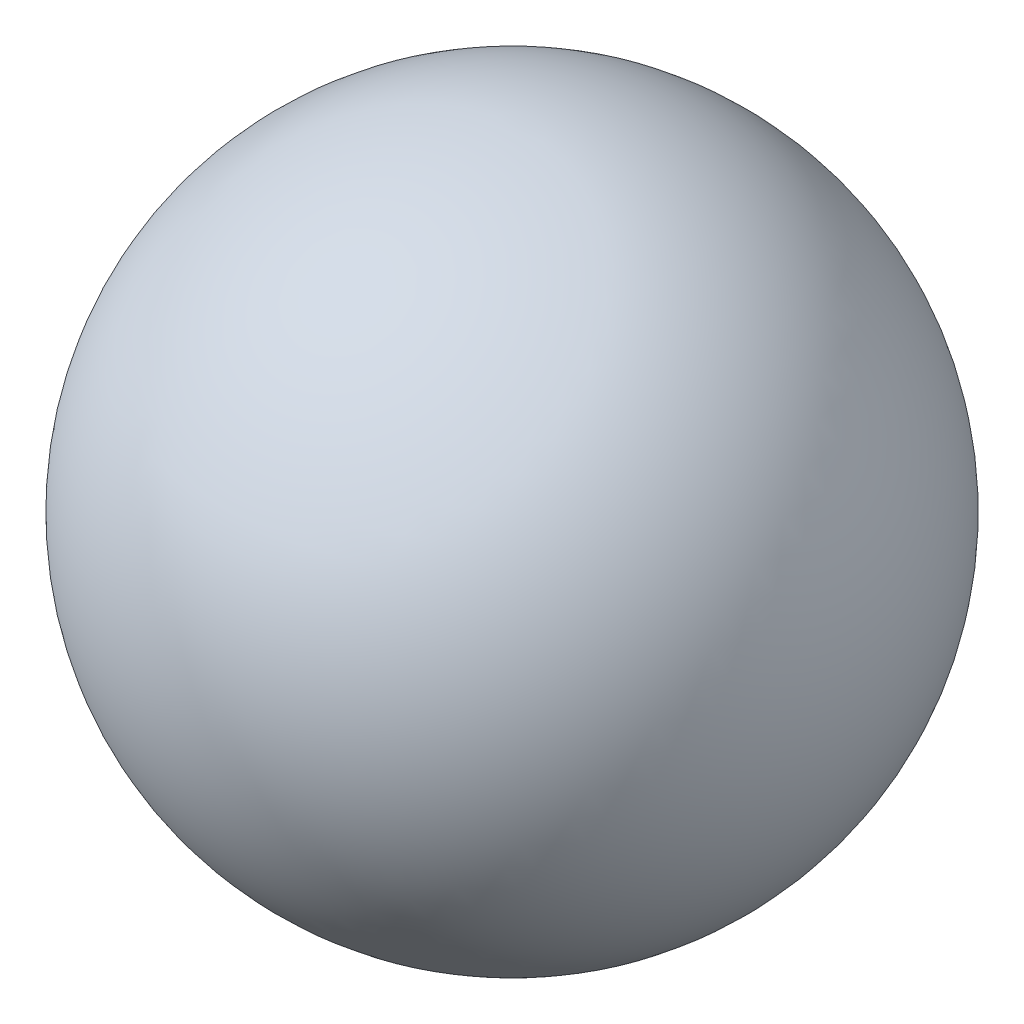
from build123d import *


with BuildPart() as part:
    # Skica1 → Oto_it kolem osy1 (revolve)
    with BuildSketch(Plane.XY):
        with BuildLine():
            Line((0, 48.875), (0, -48.875))
            ThreePointArc((0, -48.875), (-48.875, 0), (0, 48.875))
        make_face()
    revolve(axis=Axis((0, 48.875, 0), (0, -1, 0)))


solid = part.part
